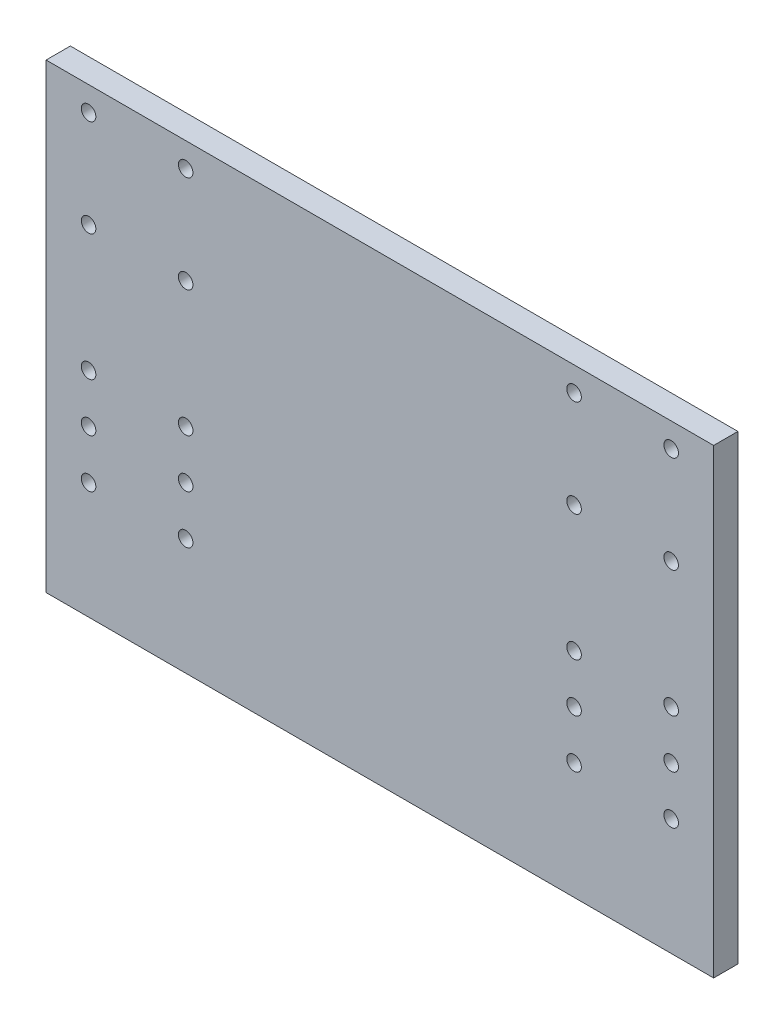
from build123d import *

# Parameters (mm, degrees)
SKETCH_1_W          = 275
SKETCH_1_H          = 190
EXTRUDE_1_DEPTH     = 10
SKETCH_2_R          = 3
CUT_EXTRUDE_1_DEPTH = 10


with BuildPart() as part:
    # Sketch 1 → Extrude 1 (new body)
    with BuildSketch(Plane.XY):
        Rectangle(SKETCH_1_W, SKETCH_1_H)
    extrude(amount=EXTRUDE_1_DEPTH)

    # Sketch 2 → Cut-Extrude 1 (cut)
    with BuildSketch(Plane.XY.offset(10)):
        with Locations((-120, -47)):
            Circle(SKETCH_2_R)
        with Locations((-120, -27)):
            Circle(SKETCH_2_R)
        with Locations((-80, -27)):
            Circle(SKETCH_2_R)
        with Locations((-80, -47)):
            Circle(SKETCH_2_R)
        with Locations(Location((80, -47, 0), (0, 0, 180))):
            Circle(SKETCH_2_R)
        with Locations(Location((80, -27, 0), (0, 0, 180))):
            Circle(SKETCH_2_R)
        with Locations(Location((120, -27, 0), (0, 0, 180))):
            Circle(SKETCH_2_R)
        with Locations(Location((120, -47, 0), (0, 0, 180))):
            Circle(SKETCH_2_R)
        with Locations((120, 85)):
            Circle(SKETCH_2_R)
        with Locations((120, 45)):
            Circle(SKETCH_2_R)
        with Locations((80, 45)):
            Circle(SKETCH_2_R)
        with Locations((80, 85)):
            Circle(SKETCH_2_R)
        with Locations(Location((-80, 85, 0), (0, 0, 180))):
            Circle(SKETCH_2_R)
        with Locations(Location((-80, 45, 0), (0, 0, 180))):
            Circle(SKETCH_2_R)
        with Locations(Location((-120, 45, 0), (0, 0, 180))):
            Circle(SKETCH_2_R)
        with Locations(Location((-120, 85, 0), (0, 0, 180))):
            Circle(SKETCH_2_R)
        with Locations((-120, -7)):
            Circle(SKETCH_2_R)
        with Locations((-80, -7)):
            Circle(SKETCH_2_R)
        with Locations(Location((80, -7, 0), (0, 0, 180))):
            Circle(SKETCH_2_R)
        with Locations(Location((120, -7, 0), (0, 0, 180))):
            Circle(SKETCH_2_R)
    extrude(amount=-CUT_EXTRUDE_1_DEPTH, mode=Mode.SUBTRACT)


solid = part.part
